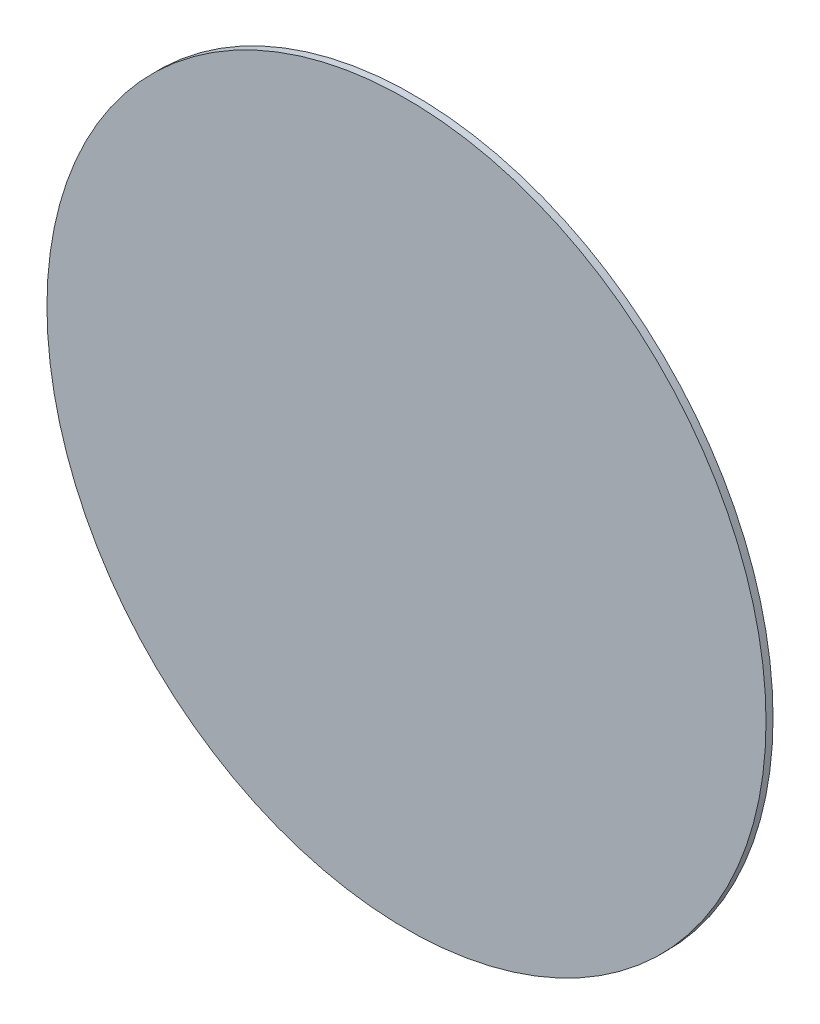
ISO-10303-21;
HEADER;
FILE_DESCRIPTION(('STEP AP214'),'2;1');
FILE_NAME('part.step','',(''),(''),'','','');
FILE_SCHEMA(('AUTOMOTIVE_DESIGN { 1 0 10303 214 1 1 1 1 }'));
ENDSEC;
DATA;
#1=APPLICATION_CONTEXT('core data for automotive mechanical design processes');
#2=APPLICATION_PROTOCOL_DEFINITION('international standard','automotive_design',2000,#1);
#3=PRODUCT_CONTEXT('',#1,'mechanical');
#4=PRODUCT('Part','Part','',(#3));
#5=PRODUCT_RELATED_PRODUCT_CATEGORY('part','',(#4));
#6=PRODUCT_DEFINITION_FORMATION('','',#4);
#7=PRODUCT_DEFINITION_CONTEXT('part definition',#1,'design');
#8=PRODUCT_DEFINITION('design','',#6,#7);
#9=PRODUCT_DEFINITION_SHAPE('','',#8);
#10=(LENGTH_UNIT() NAMED_UNIT(*) SI_UNIT(.MILLI.,.METRE.));
#11=(NAMED_UNIT(*) PLANE_ANGLE_UNIT() SI_UNIT($,.RADIAN.));
#12=(NAMED_UNIT(*) SI_UNIT($,.STERADIAN.) SOLID_ANGLE_UNIT());
#13=UNCERTAINTY_MEASURE_WITH_UNIT(LENGTH_MEASURE(1.E-05),#10,'distance_accuracy_value','');
#14=(GEOMETRIC_REPRESENTATION_CONTEXT(3) GLOBAL_UNCERTAINTY_ASSIGNED_CONTEXT((#13)) GLOBAL_UNIT_ASSIGNED_CONTEXT((#10,
#11,#12)) REPRESENTATION_CONTEXT('',''));
#15=CARTESIAN_POINT('',(0.,0.,0.));
#16=DIRECTION('',(0.,0.,1.));
#17=DIRECTION('',(1.,0.,0.));
#18=AXIS2_PLACEMENT_3D('',#15,#16,#17);
#19=CARTESIAN_POINT('',(0.,0.,0.126999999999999));
#20=DIRECTION('',(0.,0.,-1.));
#21=DIRECTION('',(-0.999999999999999,0.,0.));
#22=AXIS2_PLACEMENT_3D('',#19,#20,#21);
#23=CYLINDRICAL_SURFACE('',#22,6.5);
#24=CARTESIAN_POINT('',(0.,0.,0.126999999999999));
#25=DIRECTION('',(0.,0.,1.));
#26=DIRECTION('',(0.999999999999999,0.,0.));
#27=AXIS2_PLACEMENT_3D('',#24,#25,#26);
#28=CIRCLE('',#27,6.5);
#29=CARTESIAN_POINT('',(6.5,0.,0.126999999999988));
#30=VERTEX_POINT('',#29);
#31=EDGE_CURVE('E10',#30,#30,#28,.T.);
#32=ORIENTED_EDGE('',*,*,#31,.F.);
#33=EDGE_LOOP('',(#32));
#34=FACE_BOUND('',#33,.T.);
#35=CARTESIAN_POINT('',(0.,0.,0.));
#36=DIRECTION('',(0.,0.,1.));
#37=DIRECTION('',(0.999999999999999,0.,0.));
#38=AXIS2_PLACEMENT_3D('',#35,#36,#37);
#39=CIRCLE('',#38,6.5);
#40=CARTESIAN_POINT('',(6.5,0.,0.));
#41=VERTEX_POINT('',#40);
#42=EDGE_CURVE('E33',#41,#41,#39,.T.);
#43=ORIENTED_EDGE('',*,*,#42,.T.);
#44=EDGE_LOOP('',(#43));
#45=FACE_BOUND('',#44,.T.);
#46=ADVANCED_FACE('F27',(#34,#45),#23,.T.);
#47=CARTESIAN_POINT('',(0.,0.,0.126999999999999));
#48=DIRECTION('',(0.,0.,1.));
#49=DIRECTION('',(0.999999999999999,0.,0.));
#50=AXIS2_PLACEMENT_3D('',#47,#48,#49);
#51=PLANE('',#50);
#52=ORIENTED_EDGE('',*,*,#31,.T.);
#53=EDGE_LOOP('',(#52));
#54=FACE_BOUND('',#53,.T.);
#55=ADVANCED_FACE('F42',(#54),#51,.T.);
#56=CARTESIAN_POINT('',(0.,0.,0.));
#57=DIRECTION('',(0.,0.,1.));
#58=DIRECTION('',(0.999999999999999,0.,0.));
#59=AXIS2_PLACEMENT_3D('',#56,#57,#58);
#60=PLANE('',#59);
#61=ORIENTED_EDGE('',*,*,#42,.F.);
#62=EDGE_LOOP('',(#61));
#63=FACE_BOUND('',#62,.T.);
#64=ADVANCED_FACE('F40',(#63),#60,.F.);
#65=CLOSED_SHELL('',(#46,#55,#64));
#66=MANIFOLD_SOLID_BREP('B2',#65);
#67=ADVANCED_BREP_SHAPE_REPRESENTATION('',(#18,#66),#14);
#68=SHAPE_DEFINITION_REPRESENTATION(#9,#67);
ENDSEC;
END-ISO-10303-21;
